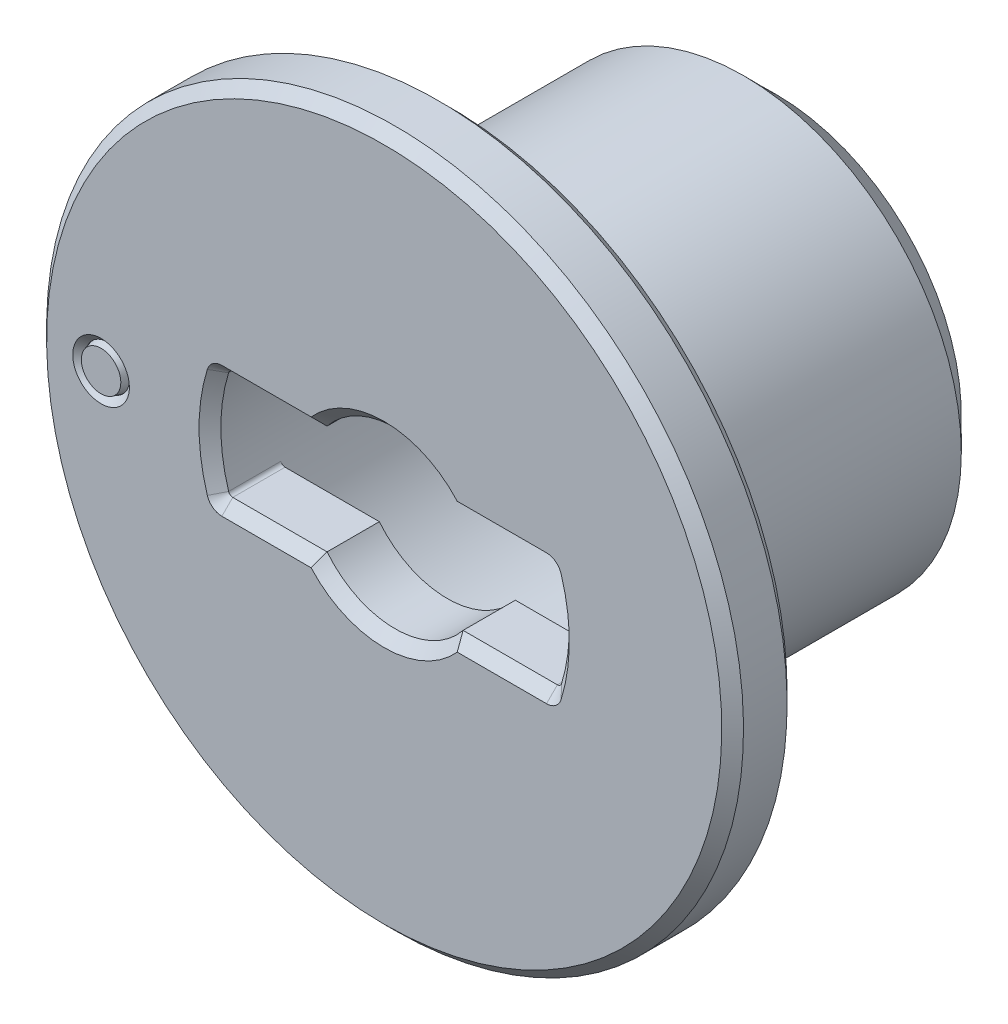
ISO-10303-21;
HEADER;
FILE_DESCRIPTION(('STEP AP214'),'2;1');
FILE_NAME('part.step','',(''),(''),'','','');
FILE_SCHEMA(('AUTOMOTIVE_DESIGN { 1 0 10303 214 1 1 1 1 }'));
ENDSEC;
DATA;
#1=APPLICATION_CONTEXT('core data for automotive mechanical design processes');
#2=APPLICATION_PROTOCOL_DEFINITION('international standard','automotive_design',2000,#1);
#3=PRODUCT_CONTEXT('',#1,'mechanical');
#4=PRODUCT('Part','Part','',(#3));
#5=PRODUCT_RELATED_PRODUCT_CATEGORY('part','',(#4));
#6=PRODUCT_DEFINITION_FORMATION('','',#4);
#7=PRODUCT_DEFINITION_CONTEXT('part definition',#1,'design');
#8=PRODUCT_DEFINITION('design','',#6,#7);
#9=PRODUCT_DEFINITION_SHAPE('','',#8);
#10=(LENGTH_UNIT() NAMED_UNIT(*) SI_UNIT(.MILLI.,.METRE.));
#11=(NAMED_UNIT(*) PLANE_ANGLE_UNIT() SI_UNIT($,.RADIAN.));
#12=(NAMED_UNIT(*) SI_UNIT($,.STERADIAN.) SOLID_ANGLE_UNIT());
#13=UNCERTAINTY_MEASURE_WITH_UNIT(LENGTH_MEASURE(1.E-05),#10,'distance_accuracy_value','');
#14=(GEOMETRIC_REPRESENTATION_CONTEXT(3) GLOBAL_UNCERTAINTY_ASSIGNED_CONTEXT((#13)) GLOBAL_UNIT_ASSIGNED_CONTEXT((#10,
#11,#12)) REPRESENTATION_CONTEXT('',''));
#15=CARTESIAN_POINT('',(0.,0.,0.));
#16=DIRECTION('',(0.,0.,1.));
#17=DIRECTION('',(1.,0.,0.));
#18=AXIS2_PLACEMENT_3D('',#15,#16,#17);
#19=CARTESIAN_POINT('',(-8.,0.,0.4));
#20=CARTESIAN_POINT('',(-8.,1.8259477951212,0.195464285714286));
#21=CARTESIAN_POINT('',(-7.20775094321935,3.47106991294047,-0.0090714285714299));
#22=CARTESIAN_POINT('',(-6.41550188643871,5.11619203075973,-0.213607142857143));
#23=CARTESIAN_POINT('',(-4.98791841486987,6.25465185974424,-0.418142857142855));
#24=CARTESIAN_POINT('',(-3.56033494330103,7.39311168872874,-0.622678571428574));
#25=CARTESIAN_POINT('',(-1.78016747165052,7.79942329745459,-0.827214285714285));
#26=CARTESIAN_POINT('',(0.,8.20573490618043,-1.03175));
#27=CARTESIAN_POINT('',(1.78016747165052,7.79942329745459,-1.23628571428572));
#28=CARTESIAN_POINT('',(3.56033494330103,7.39311168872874,-1.44082142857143));
#29=CARTESIAN_POINT('',(4.98791841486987,6.25465185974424,-1.64535714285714));
#30=CARTESIAN_POINT('',(6.41550188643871,5.11619203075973,-1.84989285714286));
#31=CARTESIAN_POINT('',(7.20775094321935,3.47106991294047,-2.05442857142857));
#32=CARTESIAN_POINT('',(8.,1.8259477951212,-2.25896428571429));
#33=CARTESIAN_POINT('',(8.,0.,-2.4635));
#34=CARTESIAN_POINT('',(0.,0.,0.4));
#35=CARTESIAN_POINT('',(0.,0.,0.195464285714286));
#36=CARTESIAN_POINT('',(0.,0.,-0.0090714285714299));
#37=CARTESIAN_POINT('',(0.,0.,-0.213607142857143));
#38=CARTESIAN_POINT('',(0.,0.,-0.418142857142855));
#39=CARTESIAN_POINT('',(0.,0.,-0.622678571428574));
#40=CARTESIAN_POINT('',(0.,0.,-0.827214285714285));
#41=CARTESIAN_POINT('',(0.,0.,-1.03175));
#42=CARTESIAN_POINT('',(0.,0.,-1.23628571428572));
#43=CARTESIAN_POINT('',(0.,0.,-1.44082142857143));
#44=CARTESIAN_POINT('',(0.,0.,-1.64535714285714));
#45=CARTESIAN_POINT('',(0.,0.,-1.84989285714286));
#46=CARTESIAN_POINT('',(0.,0.,-2.05442857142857));
#47=CARTESIAN_POINT('',(0.,0.,-2.25896428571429));
#48=CARTESIAN_POINT('',(0.,0.,-2.4635));
#49=(BOUNDED_SURFACE() B_SPLINE_SURFACE(1,2,((#19,#20,#21,#22,#23,#24,#25,#26,#27,#28,#29,#30,
#31,#32,#33),(#34,#35,#36,#37,#38,#39,#40,#41,#42,#43,#44,#45,#46,#47,#48)),.UNSPECIFIED.,.F.,
.F.,.F.) B_SPLINE_SURFACE_WITH_KNOTS((2,2),(3,2,2,2,2,2,2,3),(0.,1.),(0.,0.0714285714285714,
0.142857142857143,0.214285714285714,0.285714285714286,0.357142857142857,0.428571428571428,0.5),
.UNSPECIFIED.) GEOMETRIC_REPRESENTATION_ITEM() RATIONAL_B_SPLINE_SURFACE(((1.,0.974927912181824,
1.,0.974927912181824,1.,0.974927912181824,1.,0.974927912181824,1.,0.974927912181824,1.,
0.974927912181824,1.,0.974927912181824,1.),(1.,0.974927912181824,1.,0.974927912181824,1.,
0.974927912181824,1.,0.974927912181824,1.,0.974927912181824,1.,0.974927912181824,1.,
0.974927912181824,1.))) REPRESENTATION_ITEM('') SURFACE());
#50=CARTESIAN_POINT('',(-3.78617938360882,1.29028898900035,0.1));
#51=CARTESIAN_POINT('',(-4.41720928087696,1.50533715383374,0.1));
#52=CARTESIAN_POINT('',(-5.04823917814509,1.72038531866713,0.1));
#53=CARTESIAN_POINT('',(-6.31029897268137,2.15048164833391,0.1));
#54=CARTESIAN_POINT('',(-6.9413288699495,2.3655298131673,0.1));
#55=CARTESIAN_POINT('',(-7.57235876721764,2.5805779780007,0.1));
#56=B_SPLINE_CURVE_WITH_KNOTS('',3,(#50,#51,#52,#53,#54,#55),.UNSPECIFIED.,.F.,.F.,(4,2,4),(0.,
2.,4.),.UNSPECIFIED.);
#57=CARTESIAN_POINT('',(-7.33591353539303,2.5,0.1));
#58=VERTEX_POINT('',#57);
#59=CARTESIAN_POINT('',(-7.57235876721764,2.58057797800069,0.1));
#60=VERTEX_POINT('',#59);
#61=EDGE_CURVE('E158',#58,#60,#56,.T.);
#62=CARTESIAN_POINT('',(-3.12249899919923,2.5,-0.21538400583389));
#63=CARTESIAN_POINT('',(-3.30788065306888,2.5,-0.18878634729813));
#64=CARTESIAN_POINT('',(-3.49363193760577,2.5,-0.164973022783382));
#65=CARTESIAN_POINT('',(-3.86552133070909,2.5,-0.121901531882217));
#66=CARTESIAN_POINT('',(-4.05165903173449,2.5,-0.102639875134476));
#67=CARTESIAN_POINT('',(-4.42420773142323,2.5,-0.0676248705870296));
#68=CARTESIAN_POINT('',(-4.61061864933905,2.5,-0.0518706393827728));
#69=CARTESIAN_POINT('',(-4.98364937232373,2.5,-0.0231399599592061));
#70=CARTESIAN_POINT('',(-5.17026917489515,2.5,-0.0101634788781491));
#71=CARTESIAN_POINT('',(-5.54357650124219,2.5,0.0138371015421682));
#72=CARTESIAN_POINT('',(-5.73026398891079,2.5,0.0248617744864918));
#73=CARTESIAN_POINT('',(-6.10376909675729,2.5,0.0453426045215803));
#74=CARTESIAN_POINT('',(-6.29058673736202,2.5,0.0547983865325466));
#75=CARTESIAN_POINT('',(-6.66433826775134,2.5,0.0724315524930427));
#76=CARTESIAN_POINT('',(-6.85127217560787,2.5,0.0806085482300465));
#77=CARTESIAN_POINT('',(-7.2252467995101,2.5,0.0959030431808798));
#78=CARTESIAN_POINT('',(-7.41228753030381,2.5,0.103020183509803));
#79=CARTESIAN_POINT('',(-7.59934207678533,2.5,0.1097159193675));
#80=B_SPLINE_CURVE_WITH_KNOTS('',3,(#62,#63,#64,#65,#66,#67,#68,#69,#70,#71,#72,#73,#74,#75,#76,
#77,#78,#79),.UNSPECIFIED.,.F.,.F.,(4,2,2,2,2,2,2,2,4),(0.,0.5617764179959,1.123120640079,
1.68432331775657,2.2455193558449,2.80655019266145,3.36771496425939,3.92904976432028,
4.49057421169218),.UNSPECIFIED.);
#81=CARTESIAN_POINT('',(-7.45318723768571,2.5,0.104400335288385));
#82=VERTEX_POINT('',#81);
#83=EDGE_CURVE('E346',#58,#82,#80,.T.);
#84=CARTESIAN_POINT('',(-7.45318723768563,2.5,0.10440033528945));
#85=CARTESIAN_POINT('',(-7.46442948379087,2.50000966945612,0.104815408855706));
#86=CARTESIAN_POINT('',(-7.47566398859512,2.49905271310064,0.10533482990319));
#87=CARTESIAN_POINT('',(-7.49779714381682,2.49528138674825,0.106561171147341));
#88=CARTESIAN_POINT('',(-7.50869606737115,2.49246857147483,0.107267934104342));
#89=CARTESIAN_POINT('',(-7.52986041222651,2.48506012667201,0.108848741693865));
#90=CARTESIAN_POINT('',(-7.54012566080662,2.48046401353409,0.10972283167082));
#91=CARTESIAN_POINT('',(-7.55973156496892,2.46962801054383,0.111612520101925));
#92=CARTESIAN_POINT('',(-7.56907236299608,2.4633883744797,0.11262809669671));
#93=CARTESIAN_POINT('',(-7.58661305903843,2.44941196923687,0.114777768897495));
#94=CARTESIAN_POINT('',(-7.59480742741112,2.44166834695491,0.115912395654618));
#95=CARTESIAN_POINT('',(-7.60977612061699,2.42492375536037,0.118265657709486));
#96=CARTESIAN_POINT('',(-7.61655074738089,2.4159230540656,0.119484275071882));
#97=CARTESIAN_POINT('',(-7.62716888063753,2.39902900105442,0.121697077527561));
#98=CARTESIAN_POINT('',(-7.63132926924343,2.39133123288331,0.122681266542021));
#99=CARTESIAN_POINT('',(-7.63860678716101,2.37547097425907,0.124664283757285));
#100=CARTESIAN_POINT('',(-7.64172520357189,2.36730907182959,0.125663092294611));
#101=CARTESIAN_POINT('',(-7.6442946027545,2.35897435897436,0.126662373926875));
#102=B_SPLINE_CURVE_WITH_KNOTS('',3,(#84,#85,#86,#87,#88,#89,#90,#91,#92,#93,#94,#95,#96,#97,
#98,#99,#100,#101),.UNSPECIFIED.,.F.,.F.,(4,2,2,2,2,2,2,2,4),(0.,0.0337029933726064,
0.0673777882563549,0.101061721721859,0.13474045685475,0.168576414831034,0.202405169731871,
0.228749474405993,0.255061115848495),.UNSPECIFIED.);
#103=CARTESIAN_POINT('',(-7.6442946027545,2.35897435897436,0.12666237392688));
#104=VERTEX_POINT('',#103);
#105=EDGE_CURVE('E202',#82,#104,#102,.T.);
#106=CARTESIAN_POINT('',(-8.,0.,0.4));
#107=CARTESIAN_POINT('',(-8.,1.8259477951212,0.195464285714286));
#108=CARTESIAN_POINT('',(-7.20775094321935,3.47106991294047,-0.0090714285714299));
#109=CARTESIAN_POINT('',(-6.41550188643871,5.11619203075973,-0.213607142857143));
#110=CARTESIAN_POINT('',(-4.98791841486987,6.25465185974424,-0.418142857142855));
#111=CARTESIAN_POINT('',(-3.56033494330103,7.39311168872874,-0.622678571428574));
#112=CARTESIAN_POINT('',(-1.78016747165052,7.79942329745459,-0.827214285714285));
#113=CARTESIAN_POINT('',(0.,8.20573490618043,-1.03175));
#114=CARTESIAN_POINT('',(1.78016747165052,7.79942329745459,-1.23628571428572));
#115=CARTESIAN_POINT('',(3.56033494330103,7.39311168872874,-1.44082142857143));
#116=CARTESIAN_POINT('',(4.98791841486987,6.25465185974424,-1.64535714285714));
#117=CARTESIAN_POINT('',(6.41550188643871,5.11619203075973,-1.84989285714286));
#118=CARTESIAN_POINT('',(7.20775094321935,3.47106991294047,-2.05442857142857));
#119=CARTESIAN_POINT('',(8.,1.8259477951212,-2.25896428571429));
#120=CARTESIAN_POINT('',(8.,0.,-2.4635));
#121=(BOUNDED_CURVE() B_SPLINE_CURVE(2,(#106,#107,#108,#109,#110,#111,#112,#113,#114,#115,#116,
#117,#118,#119,#120),.UNSPECIFIED.,.F.,.F.) B_SPLINE_CURVE_WITH_KNOTS((3,2,2,2,2,2,2,3),(0.,
0.0714285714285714,0.142857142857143,0.214285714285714,0.285714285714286,0.357142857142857,
0.428571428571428,0.5),
.UNSPECIFIED.) CURVE() GEOMETRIC_REPRESENTATION_ITEM() RATIONAL_B_SPLINE_CURVE((1.,
0.974927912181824,1.,0.974927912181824,1.,0.974927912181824,1.,0.974927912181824,1.,
0.974927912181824,1.,0.974927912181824,1.,0.974927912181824,1.)) REPRESENTATION_ITEM(''));
#122=EDGE_CURVE('E343',#60,#104,#121,.F.);
#123=ORIENTED_EDGE('',*,*,#61,.F.);
#124=ORIENTED_EDGE('',*,*,#83,.T.);
#125=ORIENTED_EDGE('',*,*,#105,.T.);
#126=ORIENTED_EDGE('',*,*,#122,.F.);
#127=EDGE_LOOP('',(#123,#124,#125,#126));
#128=FACE_BOUND('',#127,.T.);
#129=ADVANCED_FACE('F14',(#128),#49,.F.);
#130=CARTESIAN_POINT('',(8.,0.,0.4));
#131=CARTESIAN_POINT('',(8.,-1.8259477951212,0.195464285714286));
#132=CARTESIAN_POINT('',(7.20775094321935,-3.47106991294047,-0.0090714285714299));
#133=CARTESIAN_POINT('',(6.41550188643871,-5.11619203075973,-0.213607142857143));
#134=CARTESIAN_POINT('',(4.98791841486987,-6.25465185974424,-0.41814285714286));
#135=CARTESIAN_POINT('',(3.56033494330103,-7.39311168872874,-0.622678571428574));
#136=CARTESIAN_POINT('',(1.78016747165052,-7.79942329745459,-0.827214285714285));
#137=CARTESIAN_POINT('',(0.,-8.20573490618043,-1.03175));
#138=CARTESIAN_POINT('',(-1.78016747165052,-7.79942329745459,-1.23628571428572));
#139=CARTESIAN_POINT('',(-3.56033494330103,-7.39311168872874,-1.44082142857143));
#140=CARTESIAN_POINT('',(-4.98791841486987,-6.25465185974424,-1.64535714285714));
#141=CARTESIAN_POINT('',(-6.41550188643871,-5.11619203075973,-1.84989285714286));
#142=CARTESIAN_POINT('',(-7.20775094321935,-3.47106991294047,-2.05442857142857));
#143=CARTESIAN_POINT('',(-8.,-1.8259477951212,-2.25896428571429));
#144=CARTESIAN_POINT('',(-8.,0.,-2.4635));
#145=CARTESIAN_POINT('',(0.,0.,0.4));
#146=CARTESIAN_POINT('',(0.,0.,0.195464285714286));
#147=CARTESIAN_POINT('',(0.,0.,-0.0090714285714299));
#148=CARTESIAN_POINT('',(0.,0.,-0.213607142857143));
#149=CARTESIAN_POINT('',(0.,0.,-0.41814285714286));
#150=CARTESIAN_POINT('',(0.,0.,-0.622678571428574));
#151=CARTESIAN_POINT('',(0.,0.,-0.827214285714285));
#152=CARTESIAN_POINT('',(0.,0.,-1.03175));
#153=CARTESIAN_POINT('',(0.,0.,-1.23628571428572));
#154=CARTESIAN_POINT('',(0.,0.,-1.44082142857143));
#155=CARTESIAN_POINT('',(0.,0.,-1.64535714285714));
#156=CARTESIAN_POINT('',(0.,0.,-1.84989285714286));
#157=CARTESIAN_POINT('',(0.,0.,-2.05442857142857));
#158=CARTESIAN_POINT('',(0.,0.,-2.25896428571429));
#159=CARTESIAN_POINT('',(0.,0.,-2.4635));
#160=(BOUNDED_SURFACE() B_SPLINE_SURFACE(1,2,((#130,#131,#132,#133,#134,#135,#136,#137,#138,
#139,#140,#141,#142,#143,#144),(#145,#146,#147,#148,#149,#150,#151,#152,#153,#154,#155,#156,
#157,#158,#159)),.UNSPECIFIED.,.F.,.F.,.F.) B_SPLINE_SURFACE_WITH_KNOTS((2,2),(3,2,2,2,2,2,2,3),
(0.,1.),(0.0625,0.125,0.1875,0.25,0.3125,0.375,0.4375,0.5),
.UNSPECIFIED.) GEOMETRIC_REPRESENTATION_ITEM() RATIONAL_B_SPLINE_SURFACE(((1.,0.974927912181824,
1.,0.974927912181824,1.,0.974927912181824,1.,0.974927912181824,1.,0.974927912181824,1.,
0.974927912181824,1.,0.974927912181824,1.),(1.,0.974927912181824,1.,0.974927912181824,1.,
0.974927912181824,1.,0.974927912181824,1.,0.974927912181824,1.,0.974927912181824,1.,
0.974927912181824,1.))) REPRESENTATION_ITEM('') SURFACE());
#161=CARTESIAN_POINT('',(3.78617938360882,-1.29028898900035,0.1));
#162=CARTESIAN_POINT('',(4.41720928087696,-1.50533715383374,0.1));
#163=CARTESIAN_POINT('',(5.04823917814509,-1.72038531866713,0.1));
#164=CARTESIAN_POINT('',(6.31029897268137,-2.15048164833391,0.1));
#165=CARTESIAN_POINT('',(6.9413288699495,-2.3655298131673,0.1));
#166=CARTESIAN_POINT('',(7.57235876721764,-2.58057797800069,0.1));
#167=B_SPLINE_CURVE_WITH_KNOTS('',3,(#161,#162,#163,#164,#165,#166),.UNSPECIFIED.,.F.,.F.,(4,2,
4),(0.,2.,4.),.UNSPECIFIED.);
#168=CARTESIAN_POINT('',(7.33591353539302,-2.5,0.1));
#169=VERTEX_POINT('',#168);
#170=CARTESIAN_POINT('',(7.57235876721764,-2.58057797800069,0.1));
#171=VERTEX_POINT('',#170);
#172=EDGE_CURVE('E591',#169,#171,#167,.T.);
#173=CARTESIAN_POINT('',(3.12249899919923,-2.5,-0.21538400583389));
#174=CARTESIAN_POINT('',(3.30788065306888,-2.5,-0.188786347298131));
#175=CARTESIAN_POINT('',(3.49363193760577,-2.5,-0.164973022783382));
#176=CARTESIAN_POINT('',(3.86552133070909,-2.5,-0.121901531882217));
#177=CARTESIAN_POINT('',(4.05165903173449,-2.5,-0.102639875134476));
#178=CARTESIAN_POINT('',(4.42420773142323,-2.5,-0.0676248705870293));
#179=CARTESIAN_POINT('',(4.61061864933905,-2.5,-0.0518706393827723));
#180=CARTESIAN_POINT('',(4.98364937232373,-2.5,-0.0231399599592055));
#181=CARTESIAN_POINT('',(5.17026917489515,-2.5,-0.0101634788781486));
#182=CARTESIAN_POINT('',(5.54357650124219,-2.5,0.0138371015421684));
#183=CARTESIAN_POINT('',(5.73026398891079,-2.5,0.024861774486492));
#184=CARTESIAN_POINT('',(6.10376909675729,-2.5,0.0453426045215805));
#185=CARTESIAN_POINT('',(6.29058673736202,-2.5,0.0547983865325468));
#186=CARTESIAN_POINT('',(6.66433826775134,-2.5,0.072431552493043));
#187=CARTESIAN_POINT('',(6.85127217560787,-2.5,0.0806085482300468));
#188=CARTESIAN_POINT('',(7.2252467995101,-2.5,0.09590304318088));
#189=CARTESIAN_POINT('',(7.41228753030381,-2.5,0.103020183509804));
#190=CARTESIAN_POINT('',(7.59934207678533,-2.5,0.1097159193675));
#191=B_SPLINE_CURVE_WITH_KNOTS('',3,(#173,#174,#175,#176,#177,#178,#179,#180,#181,#182,#183,
#184,#185,#186,#187,#188,#189,#190),.UNSPECIFIED.,.F.,.F.,(4,2,2,2,2,2,2,2,4),(0.,
0.5617764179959,1.123120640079,1.68432331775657,2.2455193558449,2.80655019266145,
3.36771496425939,3.92904976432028,4.49057421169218),.UNSPECIFIED.);
#192=CARTESIAN_POINT('',(7.45318723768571,-2.5,0.104400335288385));
#193=VERTEX_POINT('',#192);
#194=EDGE_CURVE('E461',#169,#193,#191,.T.);
#195=CARTESIAN_POINT('',(7.45318723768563,-2.5,0.10440033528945));
#196=CARTESIAN_POINT('',(7.46442948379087,-2.50000966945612,0.104815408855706));
#197=CARTESIAN_POINT('',(7.47566398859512,-2.49905271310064,0.10533482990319));
#198=CARTESIAN_POINT('',(7.49779714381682,-2.49528138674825,0.106561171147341));
#199=CARTESIAN_POINT('',(7.50869606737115,-2.49246857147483,0.107267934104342));
#200=CARTESIAN_POINT('',(7.52986041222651,-2.48506012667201,0.108848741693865));
#201=CARTESIAN_POINT('',(7.54012566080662,-2.48046401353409,0.10972283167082));
#202=CARTESIAN_POINT('',(7.55973156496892,-2.46962801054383,0.111612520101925));
#203=CARTESIAN_POINT('',(7.56907236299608,-2.4633883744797,0.11262809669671));
#204=CARTESIAN_POINT('',(7.58661305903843,-2.44941196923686,0.114777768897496));
#205=CARTESIAN_POINT('',(7.59480742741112,-2.44166834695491,0.115912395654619));
#206=CARTESIAN_POINT('',(7.60977612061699,-2.42492375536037,0.118265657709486));
#207=CARTESIAN_POINT('',(7.6165507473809,-2.4159230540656,0.119484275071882));
#208=CARTESIAN_POINT('',(7.62716888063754,-2.39902900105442,0.12169707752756));
#209=CARTESIAN_POINT('',(7.63132926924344,-2.39133123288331,0.122681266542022));
#210=CARTESIAN_POINT('',(7.63860678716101,-2.37547097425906,0.124664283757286));
#211=CARTESIAN_POINT('',(7.64172520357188,-2.36730907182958,0.125663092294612));
#212=CARTESIAN_POINT('',(7.6442946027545,-2.35897435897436,0.126662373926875));
#213=B_SPLINE_CURVE_WITH_KNOTS('',3,(#195,#196,#197,#198,#199,#200,#201,#202,#203,#204,#205,
#206,#207,#208,#209,#210,#211,#212),.UNSPECIFIED.,.F.,.F.,(4,2,2,2,2,2,2,2,4),(0.,
0.0337029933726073,0.0673777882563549,0.10106172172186,0.134740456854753,0.168576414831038,
0.202405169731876,0.228749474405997,0.2550611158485),.UNSPECIFIED.);
#214=CARTESIAN_POINT('',(7.64429460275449,-2.35897435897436,0.12666237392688));
#215=VERTEX_POINT('',#214);
#216=EDGE_CURVE('E193',#193,#215,#213,.T.);
#217=CARTESIAN_POINT('',(8.,0.,0.4));
#218=CARTESIAN_POINT('',(8.,-1.8259477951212,0.195464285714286));
#219=CARTESIAN_POINT('',(7.20775094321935,-3.47106991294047,-0.0090714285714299));
#220=CARTESIAN_POINT('',(6.41550188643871,-5.11619203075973,-0.213607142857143));
#221=CARTESIAN_POINT('',(4.98791841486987,-6.25465185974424,-0.41814285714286));
#222=CARTESIAN_POINT('',(3.56033494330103,-7.39311168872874,-0.622678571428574));
#223=CARTESIAN_POINT('',(1.78016747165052,-7.79942329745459,-0.827214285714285));
#224=CARTESIAN_POINT('',(0.,-8.20573490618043,-1.03175));
#225=CARTESIAN_POINT('',(-1.78016747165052,-7.79942329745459,-1.23628571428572));
#226=CARTESIAN_POINT('',(-3.56033494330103,-7.39311168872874,-1.44082142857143));
#227=CARTESIAN_POINT('',(-4.98791841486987,-6.25465185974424,-1.64535714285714));
#228=CARTESIAN_POINT('',(-6.41550188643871,-5.11619203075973,-1.84989285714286));
#229=CARTESIAN_POINT('',(-7.20775094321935,-3.47106991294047,-2.05442857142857));
#230=CARTESIAN_POINT('',(-8.,-1.8259477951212,-2.25896428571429));
#231=CARTESIAN_POINT('',(-8.,0.,-2.4635));
#232=(BOUNDED_CURVE() B_SPLINE_CURVE(2,(#217,#218,#219,#220,#221,#222,#223,#224,#225,#226,#227,
#228,#229,#230,#231),.UNSPECIFIED.,.F.,.F.) B_SPLINE_CURVE_WITH_KNOTS((3,2,2,2,2,2,2,3),(0.0625,
0.125,0.1875,0.25,0.3125,0.375,0.4375,0.5),
.UNSPECIFIED.) CURVE() GEOMETRIC_REPRESENTATION_ITEM() RATIONAL_B_SPLINE_CURVE((1.,
0.974927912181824,1.,0.974927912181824,1.,0.974927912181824,1.,0.974927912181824,1.,
0.974927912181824,1.,0.974927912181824,1.,0.974927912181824,1.)) REPRESENTATION_ITEM(''));
#233=EDGE_CURVE('E19',#171,#215,#232,.F.);
#234=ORIENTED_EDGE('',*,*,#172,.F.);
#235=ORIENTED_EDGE('',*,*,#194,.T.);
#236=ORIENTED_EDGE('',*,*,#216,.T.);
#237=ORIENTED_EDGE('',*,*,#233,.F.);
#238=EDGE_LOOP('',(#234,#235,#236,#237));
#239=FACE_BOUND('',#238,.T.);
#240=ADVANCED_FACE('F210',(#239),#160,.F.);
#241=CARTESIAN_POINT('',(7.45318723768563,2.3,3.));
#242=DIRECTION('',(0.,0.,1.));
#243=DIRECTION('',(0.,-1.,0.));
#244=AXIS2_PLACEMENT_3D('',#241,#242,#243);
#245=CYLINDRICAL_SURFACE('',#244,0.2);
#246=CARTESIAN_POINT('',(7.45318723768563,2.3,0.1));
#247=DIRECTION('',(0.,0.,-1.));
#248=DIRECTION('',(0.,1.,0.));
#249=AXIS2_PLACEMENT_3D('',#246,#247,#248);
#250=CIRCLE('',#249,0.2);
#251=CARTESIAN_POINT('',(7.6442946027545,2.35897435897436,0.1));
#252=VERTEX_POINT('',#251);
#253=CARTESIAN_POINT('',(7.45318723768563,2.5,0.1));
#254=VERTEX_POINT('',#253);
#255=EDGE_CURVE('E155',#252,#254,#250,.F.);
#256=ORIENTED_EDGE('',*,*,#255,.F.);
#257=DIRECTION('',(0.,0.,1.));
#258=VECTOR('',#257,1.);
#259=CARTESIAN_POINT('',(7.6442946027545,2.35897435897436,3.));
#260=LINE('',#259,#258);
#261=CARTESIAN_POINT('',(7.6442946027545,2.35897435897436,2.5));
#262=VERTEX_POINT('',#261);
#263=EDGE_CURVE('E169',#262,#252,#260,.F.);
#264=ORIENTED_EDGE('',*,*,#263,.F.);
#265=CARTESIAN_POINT('',(7.45318723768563,2.3,2.5));
#266=DIRECTION('',(0.,0.,1.));
#267=DIRECTION('',(0.,-1.,0.));
#268=AXIS2_PLACEMENT_3D('',#265,#266,#267);
#269=CIRCLE('',#268,0.2);
#270=CARTESIAN_POINT('',(7.45318723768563,2.5,2.5));
#271=VERTEX_POINT('',#270);
#272=EDGE_CURVE('E295',#262,#271,#269,.T.);
#273=ORIENTED_EDGE('',*,*,#272,.T.);
#274=DIRECTION('',(0.,0.,-1.));
#275=VECTOR('',#274,1.);
#276=CARTESIAN_POINT('',(7.45318723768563,2.5,3.));
#277=LINE('',#276,#275);
#278=EDGE_CURVE('E171',#254,#271,#277,.F.);
#279=ORIENTED_EDGE('',*,*,#278,.F.);
#280=EDGE_LOOP('',(#256,#264,#273,#279));
#281=FACE_BOUND('',#280,.T.);
#282=ADVANCED_FACE('F167',(#281),#245,.F.);
#283=CARTESIAN_POINT('',(-7.59934207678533,2.5,-2.93175));
#284=DIRECTION('',(0.,1.,0.));
#285=DIRECTION('',(-1.,0.,0.));
#286=AXIS2_PLACEMENT_3D('',#283,#284,#285);
#287=PLANE('',#286);
#288=DIRECTION('',(-1.,0.,0.));
#289=VECTOR('',#288,1.);
#290=CARTESIAN_POINT('',(-7.59934207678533,2.5,0.1));
#291=LINE('',#290,#289);
#292=CARTESIAN_POINT('',(3.1224989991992,2.5,0.1));
#293=VERTEX_POINT('',#292);
#294=EDGE_CURVE('E172',#254,#293,#291,.T.);
#295=ORIENTED_EDGE('',*,*,#294,.F.);
#296=ORIENTED_EDGE('',*,*,#278,.T.);
#297=DIRECTION('',(-1.,0.,0.));
#298=VECTOR('',#297,1.);
#299=CARTESIAN_POINT('',(3.74165738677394,2.5,2.5));
#300=LINE('',#299,#298);
#301=CARTESIAN_POINT('',(3.1224989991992,2.5,2.5));
#302=VERTEX_POINT('',#301);
#303=EDGE_CURVE('E292',#271,#302,#300,.T.);
#304=ORIENTED_EDGE('',*,*,#303,.T.);
#305=DIRECTION('',(0.,0.,1.));
#306=VECTOR('',#305,1.);
#307=CARTESIAN_POINT('',(3.1224989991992,2.5,-7.));
#308=LINE('',#307,#306);
#309=EDGE_CURVE('E470',#293,#302,#308,.T.);
#310=ORIENTED_EDGE('',*,*,#309,.F.);
#311=EDGE_LOOP('',(#295,#296,#304,#310));
#312=FACE_BOUND('',#311,.T.);
#313=ADVANCED_FACE('F495',(#312),#287,.F.);
#314=CARTESIAN_POINT('',(0.,0.,-7.));
#315=DIRECTION('',(0.,0.,1.));
#316=DIRECTION('',(0.,-1.,0.));
#317=AXIS2_PLACEMENT_3D('',#314,#315,#316);
#318=CYLINDRICAL_SURFACE('',#317,4.);
#319=CARTESIAN_POINT('',(0.,0.,0.1));
#320=DIRECTION('',(0.,0.,-1.));
#321=DIRECTION('',(0.,1.,0.));
#322=AXIS2_PLACEMENT_3D('',#319,#320,#321);
#323=CIRCLE('',#322,4.);
#324=CARTESIAN_POINT('',(-3.1224989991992,2.5,0.1));
#325=VERTEX_POINT('',#324);
#326=EDGE_CURVE('E33',#293,#325,#323,.F.);
#327=ORIENTED_EDGE('',*,*,#326,.F.);
#328=ORIENTED_EDGE('',*,*,#309,.T.);
#329=CARTESIAN_POINT('',(0.,0.,2.5));
#330=DIRECTION('',(0.,0.,1.));
#331=DIRECTION('',(0.,-1.,0.));
#332=AXIS2_PLACEMENT_3D('',#329,#330,#331);
#333=CIRCLE('',#332,4.);
#334=CARTESIAN_POINT('',(-3.1224989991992,2.5,2.5));
#335=VERTEX_POINT('',#334);
#336=EDGE_CURVE('E396',#302,#335,#333,.T.);
#337=ORIENTED_EDGE('',*,*,#336,.T.);
#338=DIRECTION('',(0.,0.,1.));
#339=VECTOR('',#338,1.);
#340=CARTESIAN_POINT('',(-3.1224989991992,2.5,-7.));
#341=LINE('',#340,#339);
#342=EDGE_CURVE('E604',#335,#325,#341,.F.);
#343=ORIENTED_EDGE('',*,*,#342,.T.);
#344=EDGE_LOOP('',(#327,#328,#337,#343));
#345=FACE_BOUND('',#344,.T.);
#346=ADVANCED_FACE('F498',(#345),#318,.F.);
#347=DIRECTION('',(-1.,0.,0.));
#348=VECTOR('',#347,1.);
#349=CARTESIAN_POINT('',(-7.59934207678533,2.5,0.1));
#350=LINE('',#349,#348);
#351=EDGE_CURVE('E598',#325,#58,#350,.T.);
#352=ORIENTED_EDGE('',*,*,#351,.F.);
#353=ORIENTED_EDGE('',*,*,#342,.F.);
#354=DIRECTION('',(-1.,0.,0.));
#355=VECTOR('',#354,1.);
#356=CARTESIAN_POINT('',(-7.45318723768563,2.5,2.5));
#357=LINE('',#356,#355);
#358=CARTESIAN_POINT('',(-7.45318723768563,2.5,2.5));
#359=VERTEX_POINT('',#358);
#360=EDGE_CURVE('E426',#335,#359,#357,.T.);
#361=ORIENTED_EDGE('',*,*,#360,.T.);
#362=DIRECTION('',(0.,0.,-1.));
#363=VECTOR('',#362,1.);
#364=CARTESIAN_POINT('',(-7.45318723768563,2.5,0.109715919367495));
#365=LINE('',#364,#363);
#366=EDGE_CURVE('E190',#359,#82,#365,.T.);
#367=ORIENTED_EDGE('',*,*,#366,.T.);
#368=ORIENTED_EDGE('',*,*,#83,.F.);
#369=EDGE_LOOP('',(#352,#353,#361,#367,#368));
#370=FACE_BOUND('',#369,.T.);
#371=ADVANCED_FACE('F229',(#370),#287,.F.);
#372=CARTESIAN_POINT('',(-7.45318723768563,-2.3,3.));
#373=DIRECTION('',(0.,0.,1.));
#374=DIRECTION('',(0.,-1.,0.));
#375=AXIS2_PLACEMENT_3D('',#372,#373,#374);
#376=CYLINDRICAL_SURFACE('',#375,0.2);
#377=CARTESIAN_POINT('',(-7.45318723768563,-2.3,0.1));
#378=DIRECTION('',(0.,0.,-1.));
#379=DIRECTION('',(0.,1.,0.));
#380=AXIS2_PLACEMENT_3D('',#377,#378,#379);
#381=CIRCLE('',#380,0.2);
#382=CARTESIAN_POINT('',(-7.6442946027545,-2.35897435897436,0.1));
#383=VERTEX_POINT('',#382);
#384=CARTESIAN_POINT('',(-7.45318723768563,-2.5,0.1));
#385=VERTEX_POINT('',#384);
#386=EDGE_CURVE('E414',#383,#385,#381,.F.);
#387=ORIENTED_EDGE('',*,*,#386,.F.);
#388=DIRECTION('',(0.,0.,1.));
#389=VECTOR('',#388,1.);
#390=CARTESIAN_POINT('',(-7.6442946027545,-2.35897435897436,3.));
#391=LINE('',#390,#389);
#392=CARTESIAN_POINT('',(-7.6442946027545,-2.35897435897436,2.5));
#393=VERTEX_POINT('',#392);
#394=EDGE_CURVE('E185',#393,#383,#391,.F.);
#395=ORIENTED_EDGE('',*,*,#394,.F.);
#396=CARTESIAN_POINT('',(-7.45318723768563,-2.3,2.5));
#397=DIRECTION('',(0.,0.,1.));
#398=DIRECTION('',(0.,-1.,0.));
#399=AXIS2_PLACEMENT_3D('',#396,#397,#398);
#400=CIRCLE('',#399,0.2);
#401=CARTESIAN_POINT('',(-7.45318723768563,-2.5,2.5));
#402=VERTEX_POINT('',#401);
#403=EDGE_CURVE('E412',#393,#402,#400,.T.);
#404=ORIENTED_EDGE('',*,*,#403,.T.);
#405=DIRECTION('',(0.,0.,-1.));
#406=VECTOR('',#405,1.);
#407=CARTESIAN_POINT('',(-7.45318723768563,-2.5,3.));
#408=LINE('',#407,#406);
#409=EDGE_CURVE('E183',#385,#402,#408,.F.);
#410=ORIENTED_EDGE('',*,*,#409,.F.);
#411=EDGE_LOOP('',(#387,#395,#404,#410));
#412=FACE_BOUND('',#411,.T.);
#413=ADVANCED_FACE('F226',(#412),#376,.F.);
#414=CARTESIAN_POINT('',(-7.59934207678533,-2.5,-2.93175));
#415=DIRECTION('',(0.,-1.,0.));
#416=DIRECTION('',(1.,0.,0.));
#417=AXIS2_PLACEMENT_3D('',#414,#415,#416);
#418=PLANE('',#417);
#419=DIRECTION('',(1.,0.,0.));
#420=VECTOR('',#419,1.);
#421=CARTESIAN_POINT('',(-7.59934207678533,-2.5,0.1));
#422=LINE('',#421,#420);
#423=CARTESIAN_POINT('',(-3.1224989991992,-2.5,0.1));
#424=VERTEX_POINT('',#423);
#425=EDGE_CURVE('E642',#385,#424,#422,.T.);
#426=ORIENTED_EDGE('',*,*,#425,.F.);
#427=ORIENTED_EDGE('',*,*,#409,.T.);
#428=DIRECTION('',(1.,0.,0.));
#429=VECTOR('',#428,1.);
#430=CARTESIAN_POINT('',(-3.74165738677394,-2.5,2.5));
#431=LINE('',#430,#429);
#432=CARTESIAN_POINT('',(-3.1224989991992,-2.5,2.5));
#433=VERTEX_POINT('',#432);
#434=EDGE_CURVE('E424',#402,#433,#431,.T.);
#435=ORIENTED_EDGE('',*,*,#434,.T.);
#436=DIRECTION('',(0.,0.,1.));
#437=VECTOR('',#436,1.);
#438=CARTESIAN_POINT('',(-3.1224989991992,-2.5,-7.));
#439=LINE('',#438,#437);
#440=EDGE_CURVE('E471',#424,#433,#439,.T.);
#441=ORIENTED_EDGE('',*,*,#440,.F.);
#442=EDGE_LOOP('',(#426,#427,#435,#441));
#443=FACE_BOUND('',#442,.T.);
#444=ADVANCED_FACE('F228',(#443),#418,.F.);
#445=CARTESIAN_POINT('',(0.,0.,-7.));
#446=DIRECTION('',(0.,0.,1.));
#447=DIRECTION('',(0.,-1.,0.));
#448=AXIS2_PLACEMENT_3D('',#445,#446,#447);
#449=CYLINDRICAL_SURFACE('',#448,4.);
#450=CARTESIAN_POINT('',(0.,0.,0.1));
#451=DIRECTION('',(0.,0.,-1.));
#452=DIRECTION('',(0.,1.,0.));
#453=AXIS2_PLACEMENT_3D('',#450,#451,#452);
#454=CIRCLE('',#453,4.);
#455=CARTESIAN_POINT('',(3.1224989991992,-2.5,0.1));
#456=VERTEX_POINT('',#455);
#457=EDGE_CURVE('E40',#424,#456,#454,.F.);
#458=ORIENTED_EDGE('',*,*,#457,.F.);
#459=ORIENTED_EDGE('',*,*,#440,.T.);
#460=CARTESIAN_POINT('',(0.,0.,2.5));
#461=DIRECTION('',(0.,0.,1.));
#462=DIRECTION('',(0.,-1.,0.));
#463=AXIS2_PLACEMENT_3D('',#460,#461,#462);
#464=CIRCLE('',#463,4.);
#465=CARTESIAN_POINT('',(3.1224989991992,-2.5,2.5));
#466=VERTEX_POINT('',#465);
#467=EDGE_CURVE('E387',#433,#466,#464,.T.);
#468=ORIENTED_EDGE('',*,*,#467,.T.);
#469=DIRECTION('',(0.,0.,1.));
#470=VECTOR('',#469,1.);
#471=CARTESIAN_POINT('',(3.1224989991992,-2.5,-7.));
#472=LINE('',#471,#470);
#473=EDGE_CURVE('E472',#466,#456,#472,.F.);
#474=ORIENTED_EDGE('',*,*,#473,.T.);
#475=EDGE_LOOP('',(#458,#459,#468,#474));
#476=FACE_BOUND('',#475,.T.);
#477=ADVANCED_FACE('F477',(#476),#449,.F.);
#478=DIRECTION('',(1.,0.,0.));
#479=VECTOR('',#478,1.);
#480=CARTESIAN_POINT('',(-7.59934207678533,-2.5,0.1));
#481=LINE('',#480,#479);
#482=EDGE_CURVE('E9',#456,#169,#481,.T.);
#483=ORIENTED_EDGE('',*,*,#482,.F.);
#484=ORIENTED_EDGE('',*,*,#473,.F.);
#485=DIRECTION('',(1.,0.,0.));
#486=VECTOR('',#485,1.);
#487=CARTESIAN_POINT('',(7.45318723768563,-2.5,2.5));
#488=LINE('',#487,#486);
#489=CARTESIAN_POINT('',(7.45318723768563,-2.5,2.5));
#490=VERTEX_POINT('',#489);
#491=EDGE_CURVE('E615',#466,#490,#488,.T.);
#492=ORIENTED_EDGE('',*,*,#491,.T.);
#493=DIRECTION('',(0.,0.,-1.));
#494=VECTOR('',#493,1.);
#495=CARTESIAN_POINT('',(7.45318723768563,-2.5,0.1097159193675));
#496=LINE('',#495,#494);
#497=EDGE_CURVE('E179',#490,#193,#496,.T.);
#498=ORIENTED_EDGE('',*,*,#497,.T.);
#499=ORIENTED_EDGE('',*,*,#194,.F.);
#500=EDGE_LOOP('',(#483,#484,#492,#498,#499));
#501=FACE_BOUND('',#500,.T.);
#502=ADVANCED_FACE('F479',(#501),#418,.F.);
#503=CARTESIAN_POINT('',(-13.,0.,3.));
#504=DIRECTION('',(0.,0.,-1.));
#505=DIRECTION('',(0.994723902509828,-0.102588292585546,0.));
#506=AXIS2_PLACEMENT_3D('',#503,#504,#505);
#507=PLANE('',#506);
#508=CARTESIAN_POINT('',(-13.,0.,3.));
#509=DIRECTION('',(0.,0.,-1.));
#510=DIRECTION('',(0.994723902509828,-0.102588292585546,0.));
#511=AXIS2_PLACEMENT_3D('',#508,#509,#510);
#512=CIRCLE('',#511,0.906217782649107);
#513=CARTESIAN_POINT('',(-12.0985635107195,-0.0929673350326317,3.));
#514=VERTEX_POINT('',#513);
#515=EDGE_CURVE('E451',#514,#514,#512,.F.);
#516=ORIENTED_EDGE('',*,*,#515,.T.);
#517=EDGE_LOOP('',(#516));
#518=FACE_BOUND('',#517,.T.);
#519=ADVANCED_FACE('F584',(#518),#507,.F.);
#520=CARTESIAN_POINT('',(-13.,0.,2.65));
#521=DIRECTION('',(0.,0.,-1.));
#522=DIRECTION('',(0.994723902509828,-0.102588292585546,0.));
#523=AXIS2_PLACEMENT_3D('',#520,#521,#522);
#524=CONICAL_SURFACE('',#523,1.,0.261799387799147);
#525=ORIENTED_EDGE('',*,*,#515,.F.);
#526=EDGE_LOOP('',(#525));
#527=FACE_BOUND('',#526,.T.);
#528=CARTESIAN_POINT('',(-13.,0.,2.65));
#529=DIRECTION('',(0.,0.,-1.));
#530=DIRECTION('',(0.994723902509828,-0.102588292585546,0.));
#531=AXIS2_PLACEMENT_3D('',#528,#529,#530);
#532=CIRCLE('',#531,1.);
#533=CARTESIAN_POINT('',(-12.0052760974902,-0.102588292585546,2.65));
#534=VERTEX_POINT('',#533);
#535=EDGE_CURVE('E440',#534,#534,#532,.T.);
#536=ORIENTED_EDGE('',*,*,#535,.F.);
#537=EDGE_LOOP('',(#536));
#538=FACE_BOUND('',#537,.T.);
#539=ADVANCED_FACE('F554',(#527,#538),#524,.T.);
#540=CARTESIAN_POINT('',(-13.,0.,-2.));
#541=DIRECTION('',(0.,0.,1.));
#542=DIRECTION('',(-0.994723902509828,0.102588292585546,0.));
#543=AXIS2_PLACEMENT_3D('',#540,#541,#542);
#544=CYLINDRICAL_SURFACE('',#543,1.);
#545=CARTESIAN_POINT('',(-13.,0.,0.3));
#546=DIRECTION('',(0.,0.,-1.));
#547=DIRECTION('',(0.,1.,0.));
#548=AXIS2_PLACEMENT_3D('',#545,#546,#547);
#549=CIRCLE('',#548,1.);
#550=CARTESIAN_POINT('',(-13.,1.,0.3));
#551=VERTEX_POINT('',#550);
#552=EDGE_CURVE('E25',#551,#551,#549,.T.);
#553=ORIENTED_EDGE('',*,*,#552,.T.);
#554=EDGE_LOOP('',(#553));
#555=FACE_BOUND('',#554,.T.);
#556=CARTESIAN_POINT('',(-13.,0.,-1.8));
#557=DIRECTION('',(0.,0.,-1.));
#558=DIRECTION('',(0.994723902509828,-0.102588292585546,0.));
#559=AXIS2_PLACEMENT_3D('',#556,#557,#558);
#560=CIRCLE('',#559,1.);
#561=CARTESIAN_POINT('',(-12.0052760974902,-0.102588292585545,-1.8));
#562=VERTEX_POINT('',#561);
#563=EDGE_CURVE('E435',#562,#562,#560,.F.);
#564=ORIENTED_EDGE('',*,*,#563,.T.);
#565=EDGE_LOOP('',(#564));
#566=FACE_BOUND('',#565,.T.);
#567=ADVANCED_FACE('F576',(#555,#566),#544,.T.);
#568=CARTESIAN_POINT('',(-13.,0.,-2.));
#569=DIRECTION('',(0.,0.,-1.));
#570=DIRECTION('',(0.994723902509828,-0.102588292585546,0.));
#571=AXIS2_PLACEMENT_3D('',#568,#569,#570);
#572=PLANE('',#571);
#573=CARTESIAN_POINT('',(-13.,0.,-2.));
#574=DIRECTION('',(0.,0.,-1.));
#575=DIRECTION('',(0.994723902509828,-0.102588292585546,0.));
#576=AXIS2_PLACEMENT_3D('',#573,#574,#575);
#577=CIRCLE('',#576,0.8);
#578=CARTESIAN_POINT('',(-12.2042208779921,-0.0820706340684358,-2.));
#579=VERTEX_POINT('',#578);
#580=EDGE_CURVE('E429',#579,#579,#577,.T.);
#581=ORIENTED_EDGE('',*,*,#580,.T.);
#582=EDGE_LOOP('',(#581));
#583=FACE_BOUND('',#582,.T.);
#584=ADVANCED_FACE('F564',(#583),#572,.T.);
#585=CARTESIAN_POINT('',(-13.,0.,-2.));
#586=DIRECTION('',(0.,0.,1.));
#587=DIRECTION('',(-0.994723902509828,0.102588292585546,0.));
#588=AXIS2_PLACEMENT_3D('',#585,#586,#587);
#589=CONICAL_SURFACE('',#588,0.8,0.785398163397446);
#590=ORIENTED_EDGE('',*,*,#563,.F.);
#591=EDGE_LOOP('',(#590));
#592=FACE_BOUND('',#591,.T.);
#593=ORIENTED_EDGE('',*,*,#580,.F.);
#594=EDGE_LOOP('',(#593));
#595=FACE_BOUND('',#594,.T.);
#596=ADVANCED_FACE('F550',(#592,#595),#589,.T.);
#597=CARTESIAN_POINT('',(10.,0.,-15.));
#598=DIRECTION('',(0.,0.,1.));
#599=DIRECTION('',(0.,-1.,0.));
#600=AXIS2_PLACEMENT_3D('',#597,#598,#599);
#601=PLANE('',#600);
#602=CARTESIAN_POINT('',(0.,0.,-15.));
#603=DIRECTION('',(0.,0.,1.));
#604=DIRECTION('',(0.,-1.,0.));
#605=AXIS2_PLACEMENT_3D('',#602,#603,#604);
#606=CIRCLE('',#605,8.5);
#607=CARTESIAN_POINT('',(0.,-8.5,-15.));
#608=VERTEX_POINT('',#607);
#609=EDGE_CURVE('E375',#608,#608,#606,.F.);
#610=ORIENTED_EDGE('',*,*,#609,.T.);
#611=EDGE_LOOP('',(#610));
#612=FACE_BOUND('',#611,.T.);
#613=CARTESIAN_POINT('',(0.,0.,-15.));
#614=DIRECTION('',(0.,0.,1.));
#615=DIRECTION('',(0.,-1.,0.));
#616=AXIS2_PLACEMENT_3D('',#613,#614,#615);
#617=CIRCLE('',#616,8.);
#618=CARTESIAN_POINT('',(0.,-8.,-15.));
#619=VERTEX_POINT('',#618);
#620=EDGE_CURVE('E332',#619,#619,#617,.T.);
#621=ORIENTED_EDGE('',*,*,#620,.T.);
#622=EDGE_LOOP('',(#621));
#623=FACE_BOUND('',#622,.T.);
#624=ADVANCED_FACE('F492',(#612,#623),#601,.F.);
#625=CARTESIAN_POINT('',(0.,0.,-13.5));
#626=DIRECTION('',(0.,0.,1.));
#627=DIRECTION('',(0.,-1.,0.));
#628=AXIS2_PLACEMENT_3D('',#625,#626,#627);
#629=CONICAL_SURFACE('',#628,10.,0.785398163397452);
#630=ORIENTED_EDGE('',*,*,#609,.F.);
#631=EDGE_LOOP('',(#630));
#632=FACE_BOUND('',#631,.T.);
#633=CARTESIAN_POINT('',(0.,0.,-13.5));
#634=DIRECTION('',(0.,0.,1.));
#635=DIRECTION('',(0.,-1.,0.));
#636=AXIS2_PLACEMENT_3D('',#633,#634,#635);
#637=CIRCLE('',#636,10.);
#638=CARTESIAN_POINT('',(0.,-10.,-13.5));
#639=VERTEX_POINT('',#638);
#640=EDGE_CURVE('E372',#639,#639,#637,.T.);
#641=ORIENTED_EDGE('',*,*,#640,.F.);
#642=EDGE_LOOP('',(#641));
#643=FACE_BOUND('',#642,.T.);
#644=ADVANCED_FACE('F234',(#632,#643),#629,.T.);
#645=CARTESIAN_POINT('',(-7.45318723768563,2.3,3.));
#646=DIRECTION('',(0.,0.,1.));
#647=DIRECTION('',(0.,-1.,0.));
#648=AXIS2_PLACEMENT_3D('',#645,#646,#647);
#649=CYLINDRICAL_SURFACE('',#648,0.2);
#650=ORIENTED_EDGE('',*,*,#366,.F.);
#651=CARTESIAN_POINT('',(-7.45318723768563,2.3,2.5));
#652=DIRECTION('',(0.,0.,1.));
#653=DIRECTION('',(0.,-1.,0.));
#654=AXIS2_PLACEMENT_3D('',#651,#652,#653);
#655=CIRCLE('',#654,0.2);
#656=CARTESIAN_POINT('',(-7.6442946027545,2.35897435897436,2.5));
#657=VERTEX_POINT('',#656);
#658=EDGE_CURVE('E423',#359,#657,#655,.T.);
#659=ORIENTED_EDGE('',*,*,#658,.T.);
#660=DIRECTION('',(0.,0.,1.));
#661=VECTOR('',#660,1.);
#662=CARTESIAN_POINT('',(-7.6442946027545,2.35897435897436,3.));
#663=LINE('',#662,#661);
#664=EDGE_CURVE('E406',#104,#657,#663,.T.);
#665=ORIENTED_EDGE('',*,*,#664,.F.);
#666=ORIENTED_EDGE('',*,*,#105,.F.);
#667=EDGE_LOOP('',(#650,#659,#665,#666));
#668=FACE_BOUND('',#667,.T.);
#669=ADVANCED_FACE('F223',(#668),#649,.F.);
#670=CARTESIAN_POINT('',(0.,0.,3.));
#671=DIRECTION('',(0.,0.,1.));
#672=DIRECTION('',(0.,-1.,0.));
#673=AXIS2_PLACEMENT_3D('',#670,#671,#672);
#674=CYLINDRICAL_SURFACE('',#673,8.);
#675=CARTESIAN_POINT('',(0.,0.,0.1));
#676=DIRECTION('',(0.,0.,-1.));
#677=DIRECTION('',(0.,1.,0.));
#678=AXIS2_PLACEMENT_3D('',#675,#676,#677);
#679=CIRCLE('',#678,8.);
#680=EDGE_CURVE('E152',#60,#252,#679,.T.);
#681=ORIENTED_EDGE('',*,*,#680,.F.);
#682=ORIENTED_EDGE('',*,*,#122,.T.);
#683=ORIENTED_EDGE('',*,*,#664,.T.);
#684=CARTESIAN_POINT('',(0.,0.,2.5));
#685=DIRECTION('',(0.,0.,1.));
#686=DIRECTION('',(0.,-1.,0.));
#687=AXIS2_PLACEMENT_3D('',#684,#685,#686);
#688=CIRCLE('',#687,8.);
#689=EDGE_CURVE('E297',#657,#393,#688,.T.);
#690=ORIENTED_EDGE('',*,*,#689,.T.);
#691=ORIENTED_EDGE('',*,*,#394,.T.);
#692=EDGE_CURVE('E162',#171,#383,#679,.T.);
#693=ORIENTED_EDGE('',*,*,#692,.F.);
#694=ORIENTED_EDGE('',*,*,#233,.T.);
#695=DIRECTION('',(0.,0.,1.));
#696=VECTOR('',#695,1.);
#697=CARTESIAN_POINT('',(7.6442946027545,-2.35897435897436,3.));
#698=LINE('',#697,#696);
#699=CARTESIAN_POINT('',(7.6442946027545,-2.35897435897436,2.5));
#700=VERTEX_POINT('',#699);
#701=EDGE_CURVE('E180',#215,#700,#698,.T.);
#702=ORIENTED_EDGE('',*,*,#701,.T.);
#703=CARTESIAN_POINT('',(0.,0.,2.5));
#704=DIRECTION('',(0.,0.,1.));
#705=DIRECTION('',(0.,-1.,0.));
#706=AXIS2_PLACEMENT_3D('',#703,#704,#705);
#707=CIRCLE('',#706,8.);
#708=EDGE_CURVE('E178',#700,#262,#707,.T.);
#709=ORIENTED_EDGE('',*,*,#708,.T.);
#710=ORIENTED_EDGE('',*,*,#263,.T.);
#711=EDGE_LOOP('',(#681,#682,#683,#690,#691,#693,#694,#702,#709,#710));
#712=FACE_BOUND('',#711,.T.);
#713=ORIENTED_EDGE('',*,*,#620,.F.);
#714=EDGE_LOOP('',(#713));
#715=FACE_BOUND('',#714,.T.);
#716=ADVANCED_FACE('F174',(#712,#715),#674,.F.);
#717=CARTESIAN_POINT('',(7.45318723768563,-2.3,3.));
#718=DIRECTION('',(0.,0.,1.));
#719=DIRECTION('',(0.,-1.,0.));
#720=AXIS2_PLACEMENT_3D('',#717,#718,#719);
#721=CYLINDRICAL_SURFACE('',#720,0.2);
#722=ORIENTED_EDGE('',*,*,#497,.F.);
#723=CARTESIAN_POINT('',(7.45318723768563,-2.3,2.5));
#724=DIRECTION('',(0.,0.,1.));
#725=DIRECTION('',(0.,-1.,0.));
#726=AXIS2_PLACEMENT_3D('',#723,#724,#725);
#727=CIRCLE('',#726,0.2);
#728=EDGE_CURVE('E254',#490,#700,#727,.T.);
#729=ORIENTED_EDGE('',*,*,#728,.T.);
#730=ORIENTED_EDGE('',*,*,#701,.F.);
#731=ORIENTED_EDGE('',*,*,#216,.F.);
#732=EDGE_LOOP('',(#722,#729,#730,#731));
#733=FACE_BOUND('',#732,.T.);
#734=ADVANCED_FACE('F216',(#733),#721,.F.);
#735=CARTESIAN_POINT('',(0.,0.,3.));
#736=DIRECTION('',(0.,0.,1.));
#737=DIRECTION('',(0.,-1.,0.));
#738=AXIS2_PLACEMENT_3D('',#735,#736,#737);
#739=CYLINDRICAL_SURFACE('',#738,16.);
#740=CARTESIAN_POINT('',(0.,0.,0.5));
#741=DIRECTION('',(0.,0.,1.));
#742=DIRECTION('',(0.,-1.,0.));
#743=AXIS2_PLACEMENT_3D('',#740,#741,#742);
#744=CIRCLE('',#743,16.);
#745=CARTESIAN_POINT('',(0.,-16.,0.5));
#746=VERTEX_POINT('',#745);
#747=EDGE_CURVE('E363',#746,#746,#744,.T.);
#748=ORIENTED_EDGE('',*,*,#747,.T.);
#749=EDGE_LOOP('',(#748));
#750=FACE_BOUND('',#749,.T.);
#751=CARTESIAN_POINT('',(0.,0.,2.5));
#752=DIRECTION('',(0.,0.,1.));
#753=DIRECTION('',(0.,-1.,0.));
#754=AXIS2_PLACEMENT_3D('',#751,#752,#753);
#755=CIRCLE('',#754,16.);
#756=CARTESIAN_POINT('',(0.,-16.,2.5));
#757=VERTEX_POINT('',#756);
#758=EDGE_CURVE('E345',#757,#757,#755,.F.);
#759=ORIENTED_EDGE('',*,*,#758,.T.);
#760=EDGE_LOOP('',(#759));
#761=FACE_BOUND('',#760,.T.);
#762=ADVANCED_FACE('F221',(#750,#761),#739,.T.);
#763=CARTESIAN_POINT('',(0.,0.,3.));
#764=DIRECTION('',(0.,0.,1.));
#765=DIRECTION('',(0.,-1.,0.));
#766=AXIS2_PLACEMENT_3D('',#763,#764,#765);
#767=CYLINDRICAL_SURFACE('',#766,10.);
#768=CARTESIAN_POINT('',(0.,0.,-0.4));
#769=DIRECTION('',(0.,0.,1.));
#770=DIRECTION('',(0.,-1.,0.));
#771=AXIS2_PLACEMENT_3D('',#768,#769,#770);
#772=CIRCLE('',#771,10.);
#773=CARTESIAN_POINT('',(0.,-10.,-0.4));
#774=VERTEX_POINT('',#773);
#775=EDGE_CURVE('E399',#774,#774,#772,.F.);
#776=ORIENTED_EDGE('',*,*,#775,.T.);
#777=EDGE_LOOP('',(#776));
#778=FACE_BOUND('',#777,.T.);
#779=ORIENTED_EDGE('',*,*,#640,.T.);
#780=EDGE_LOOP('',(#779));
#781=FACE_BOUND('',#780,.T.);
#782=ADVANCED_FACE('F490',(#778,#781),#767,.T.);
#783=CARTESIAN_POINT('',(0.,0.,0.5));
#784=DIRECTION('',(0.,0.,1.));
#785=DIRECTION('',(0.,-1.,0.));
#786=AXIS2_PLACEMENT_3D('',#783,#784,#785);
#787=CONICAL_SURFACE('',#786,16.,0.785398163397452);
#788=CARTESIAN_POINT('',(0.,0.,0.));
#789=DIRECTION('',(0.,0.,1.));
#790=DIRECTION('',(0.,-1.,0.));
#791=AXIS2_PLACEMENT_3D('',#788,#789,#790);
#792=CIRCLE('',#791,15.5);
#793=CARTESIAN_POINT('',(0.,-15.5,0.));
#794=VERTEX_POINT('',#793);
#795=EDGE_CURVE('E366',#794,#794,#792,.F.);
#796=ORIENTED_EDGE('',*,*,#795,.F.);
#797=EDGE_LOOP('',(#796));
#798=FACE_BOUND('',#797,.T.);
#799=ORIENTED_EDGE('',*,*,#747,.F.);
#800=EDGE_LOOP('',(#799));
#801=FACE_BOUND('',#800,.T.);
#802=ADVANCED_FACE('F520',(#798,#801),#787,.T.);
#803=CARTESIAN_POINT('',(0.,0.,-0.4));
#804=DIRECTION('',(0.,0.,1.));
#805=DIRECTION('',(0.,-1.,0.));
#806=AXIS2_PLACEMENT_3D('',#803,#804,#805);
#807=TOROIDAL_SURFACE('',#806,10.4,0.4);
#808=CARTESIAN_POINT('',(0.,0.,0.));
#809=DIRECTION('',(0.,0.,1.));
#810=DIRECTION('',(0.,-1.,0.));
#811=AXIS2_PLACEMENT_3D('',#808,#809,#810);
#812=CIRCLE('',#811,10.4);
#813=CARTESIAN_POINT('',(0.,-10.4,0.));
#814=VERTEX_POINT('',#813);
#815=EDGE_CURVE('E402',#814,#814,#812,.T.);
#816=ORIENTED_EDGE('',*,*,#815,.F.);
#817=EDGE_LOOP('',(#816));
#818=FACE_BOUND('',#817,.T.);
#819=ORIENTED_EDGE('',*,*,#775,.F.);
#820=EDGE_LOOP('',(#819));
#821=FACE_BOUND('',#820,.T.);
#822=ADVANCED_FACE('F224',(#818,#821),#807,.F.);
#823=CARTESIAN_POINT('',(16.,0.,0.));
#824=DIRECTION('',(0.,0.,1.));
#825=DIRECTION('',(0.,-1.,0.));
#826=AXIS2_PLACEMENT_3D('',#823,#824,#825);
#827=PLANE('',#826);
#828=ORIENTED_EDGE('',*,*,#815,.T.);
#829=EDGE_LOOP('',(#828));
#830=FACE_BOUND('',#829,.T.);
#831=CARTESIAN_POINT('',(-13.,0.,0.));
#832=DIRECTION('',(0.,0.,1.));
#833=DIRECTION('',(0.,-1.,0.));
#834=AXIS2_PLACEMENT_3D('',#831,#832,#833);
#835=CIRCLE('',#834,1.3);
#836=CARTESIAN_POINT('',(-13.,-1.3,0.));
#837=VERTEX_POINT('',#836);
#838=EDGE_CURVE('E378',#837,#837,#835,.T.);
#839=ORIENTED_EDGE('',*,*,#838,.T.);
#840=EDGE_LOOP('',(#839));
#841=FACE_BOUND('',#840,.T.);
#842=ORIENTED_EDGE('',*,*,#795,.T.);
#843=EDGE_LOOP('',(#842));
#844=FACE_BOUND('',#843,.T.);
#845=ADVANCED_FACE('F483',(#830,#841,#844),#827,.F.);
#846=CARTESIAN_POINT('',(-13.,0.,0.));
#847=DIRECTION('',(0.,0.,-1.));
#848=DIRECTION('',(0.,1.,0.));
#849=AXIS2_PLACEMENT_3D('',#846,#847,#848);
#850=CONICAL_SURFACE('',#849,1.3,0.785398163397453);
#851=ORIENTED_EDGE('',*,*,#552,.F.);
#852=EDGE_LOOP('',(#851));
#853=FACE_BOUND('',#852,.T.);
#854=ORIENTED_EDGE('',*,*,#838,.F.);
#855=EDGE_LOOP('',(#854));
#856=FACE_BOUND('',#855,.T.);
#857=ADVANCED_FACE('F486',(#853,#856),#850,.F.);
#858=CARTESIAN_POINT('',(0.,0.,2.5));
#859=DIRECTION('',(0.,0.,1.));
#860=DIRECTION('',(0.,-1.,0.));
#861=AXIS2_PLACEMENT_3D('',#858,#859,#860);
#862=CONICAL_SURFACE('',#861,8.,0.785398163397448);
#863=DIRECTION('',(-0.675666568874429,-0.208505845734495,-0.707106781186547));
#864=VECTOR('',#863,1.);
#865=CARTESIAN_POINT('',(8.12206301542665,2.50641025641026,3.));
#866=LINE('',#865,#864);
#867=CARTESIAN_POINT('',(8.12206301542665,2.50641025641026,3.));
#868=VERTEX_POINT('',#867);
#869=EDGE_CURVE('E320',#868,#262,#866,.T.);
#870=ORIENTED_EDGE('',*,*,#869,.T.);
#871=ORIENTED_EDGE('',*,*,#708,.F.);
#872=DIRECTION('',(-0.675666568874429,0.208505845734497,-0.707106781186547));
#873=VECTOR('',#872,1.);
#874=CARTESIAN_POINT('',(8.12206301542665,-2.50641025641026,3.));
#875=LINE('',#874,#873);
#876=CARTESIAN_POINT('',(8.12206301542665,-2.50641025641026,3.));
#877=VERTEX_POINT('',#876);
#878=EDGE_CURVE('E317',#877,#700,#875,.T.);
#879=ORIENTED_EDGE('',*,*,#878,.F.);
#880=CARTESIAN_POINT('',(0.,0.,3.));
#881=DIRECTION('',(0.,0.,1.));
#882=DIRECTION('',(0.,-1.,0.));
#883=AXIS2_PLACEMENT_3D('',#880,#881,#882);
#884=CIRCLE('',#883,8.5);
#885=EDGE_CURVE('E634',#868,#877,#884,.F.);
#886=ORIENTED_EDGE('',*,*,#885,.F.);
#887=EDGE_LOOP('',(#870,#871,#879,#886));
#888=FACE_BOUND('',#887,.T.);
#889=ADVANCED_FACE('F315',(#888),#862,.F.);
#890=CARTESIAN_POINT('',(7.45318723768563,2.3,3.));
#891=DIRECTION('',(0.,0.,1.));
#892=DIRECTION('',(0.,-1.,0.));
#893=AXIS2_PLACEMENT_3D('',#890,#891,#892);
#894=CONICAL_SURFACE('',#893,0.7,0.785398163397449);
#895=DIRECTION('',(0.,-0.707106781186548,-0.707106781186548));
#896=VECTOR('',#895,1.);
#897=CARTESIAN_POINT('',(7.45318723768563,3.,3.));
#898=LINE('',#897,#896);
#899=CARTESIAN_POINT('',(7.45318723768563,3.,3.));
#900=VERTEX_POINT('',#899);
#901=EDGE_CURVE('E324',#900,#271,#898,.T.);
#902=ORIENTED_EDGE('',*,*,#901,.T.);
#903=ORIENTED_EDGE('',*,*,#272,.F.);
#904=ORIENTED_EDGE('',*,*,#869,.F.);
#905=CARTESIAN_POINT('',(7.45318723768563,2.3,3.));
#906=DIRECTION('',(0.,0.,1.));
#907=DIRECTION('',(0.,-1.,0.));
#908=AXIS2_PLACEMENT_3D('',#905,#906,#907);
#909=CIRCLE('',#908,0.7);
#910=EDGE_CURVE('E632',#900,#868,#909,.F.);
#911=ORIENTED_EDGE('',*,*,#910,.F.);
#912=EDGE_LOOP('',(#902,#903,#904,#911));
#913=FACE_BOUND('',#912,.T.);
#914=ADVANCED_FACE('F537',(#913),#894,.F.);
#915=CARTESIAN_POINT('',(-7.59934207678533,2.5,2.5));
#916=DIRECTION('',(0.,-0.707106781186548,0.707106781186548));
#917=DIRECTION('',(0.,-0.707106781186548,-0.707106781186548));
#918=AXIS2_PLACEMENT_3D('',#915,#916,#917);
#919=PLANE('',#918);
#920=CARTESIAN_POINT('',(3.1224989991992,2.5,2.5));
#921=CARTESIAN_POINT('',(3.16234584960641,2.58304482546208,2.58304482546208));
#922=CARTESIAN_POINT('',(3.20156955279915,2.6662339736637,2.6662339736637));
#923=CARTESIAN_POINT('',(3.2787705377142,2.83290064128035,2.83290064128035));
#924=CARTESIAN_POINT('',(3.31674782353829,2.9163781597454,2.9163781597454));
#925=CARTESIAN_POINT('',(3.35410196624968,3.,3.));
#926=B_SPLINE_CURVE_WITH_KNOTS('',3,(#920,#921,#922,#923,#924,#925),.UNSPECIFIED.,.F.,.F.,(4,2,
4),(0.,0.372040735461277,0.74408024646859),.UNSPECIFIED.);
#927=CARTESIAN_POINT('',(3.35410196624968,3.,3.));
#928=VERTEX_POINT('',#927);
#929=EDGE_CURVE('E278',#302,#928,#926,.T.);
#930=ORIENTED_EDGE('',*,*,#929,.F.);
#931=ORIENTED_EDGE('',*,*,#303,.F.);
#932=ORIENTED_EDGE('',*,*,#901,.F.);
#933=DIRECTION('',(1.,0.,0.));
#934=VECTOR('',#933,1.);
#935=CARTESIAN_POINT('',(7.45318723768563,3.,3.));
#936=LINE('',#935,#934);
#937=EDGE_CURVE('E630',#928,#900,#936,.T.);
#938=ORIENTED_EDGE('',*,*,#937,.F.);
#939=EDGE_LOOP('',(#930,#931,#932,#938));
#940=FACE_BOUND('',#939,.T.);
#941=ADVANCED_FACE('F236',(#940),#919,.T.);
#942=CARTESIAN_POINT('',(0.,0.,2.5));
#943=DIRECTION('',(0.,0.,1.));
#944=DIRECTION('',(0.,-1.,0.));
#945=AXIS2_PLACEMENT_3D('',#942,#943,#944);
#946=CONICAL_SURFACE('',#945,4.,0.785398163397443);
#947=ORIENTED_EDGE('',*,*,#336,.F.);
#948=ORIENTED_EDGE('',*,*,#929,.T.);
#949=CARTESIAN_POINT('',(0.,0.,3.));
#950=DIRECTION('',(0.,0.,1.));
#951=DIRECTION('',(0.,-1.,0.));
#952=AXIS2_PLACEMENT_3D('',#949,#950,#951);
#953=CIRCLE('',#952,4.5);
#954=CARTESIAN_POINT('',(-3.35410196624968,3.,3.));
#955=VERTEX_POINT('',#954);
#956=EDGE_CURVE('E390',#955,#928,#953,.F.);
#957=ORIENTED_EDGE('',*,*,#956,.F.);
#958=CARTESIAN_POINT('',(-3.35410196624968,3.,3.));
#959=CARTESIAN_POINT('',(-3.31674782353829,2.9163781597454,2.9163781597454));
#960=CARTESIAN_POINT('',(-3.2787705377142,2.83290064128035,2.83290064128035));
#961=CARTESIAN_POINT('',(-3.20156955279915,2.6662339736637,2.6662339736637));
#962=CARTESIAN_POINT('',(-3.16234584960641,2.58304482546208,2.58304482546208));
#963=CARTESIAN_POINT('',(-3.1224989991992,2.5,2.5));
#964=B_SPLINE_CURVE_WITH_KNOTS('',3,(#958,#959,#960,#961,#962,#963),.UNSPECIFIED.,.F.,.F.,(4,2,
4),(0.,0.372039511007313,0.74408024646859),.UNSPECIFIED.);
#965=EDGE_CURVE('E286',#955,#335,#964,.T.);
#966=ORIENTED_EDGE('',*,*,#965,.T.);
#967=EDGE_LOOP('',(#947,#948,#957,#966));
#968=FACE_BOUND('',#967,.T.);
#969=ADVANCED_FACE('F269',(#968),#946,.F.);
#970=CARTESIAN_POINT('',(-7.59934207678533,2.5,2.5));
#971=DIRECTION('',(0.,-0.707106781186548,0.707106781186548));
#972=DIRECTION('',(0.,-0.707106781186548,-0.707106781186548));
#973=AXIS2_PLACEMENT_3D('',#970,#971,#972);
#974=PLANE('',#973);
#975=ORIENTED_EDGE('',*,*,#965,.F.);
#976=DIRECTION('',(1.,0.,0.));
#977=VECTOR('',#976,1.);
#978=CARTESIAN_POINT('',(-3.74165738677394,3.,3.));
#979=LINE('',#978,#977);
#980=CARTESIAN_POINT('',(-7.45318723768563,3.,3.));
#981=VERTEX_POINT('',#980);
#982=EDGE_CURVE('E619',#981,#955,#979,.T.);
#983=ORIENTED_EDGE('',*,*,#982,.F.);
#984=DIRECTION('',(0.,0.707106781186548,0.707106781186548));
#985=VECTOR('',#984,1.);
#986=CARTESIAN_POINT('',(-7.45318723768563,2.5,2.5));
#987=LINE('',#986,#985);
#988=EDGE_CURVE('E326',#359,#981,#987,.T.);
#989=ORIENTED_EDGE('',*,*,#988,.F.);
#990=ORIENTED_EDGE('',*,*,#360,.F.);
#991=EDGE_LOOP('',(#975,#983,#989,#990));
#992=FACE_BOUND('',#991,.T.);
#993=ADVANCED_FACE('F16',(#992),#974,.T.);
#994=CARTESIAN_POINT('',(-7.45318723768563,2.3,3.));
#995=DIRECTION('',(0.,0.,1.));
#996=DIRECTION('',(0.,-1.,0.));
#997=AXIS2_PLACEMENT_3D('',#994,#995,#996);
#998=CONICAL_SURFACE('',#997,0.7,0.785398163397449);
#999=ORIENTED_EDGE('',*,*,#988,.T.);
#1000=CARTESIAN_POINT('',(-7.45318723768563,2.3,3.));
#1001=DIRECTION('',(0.,0.,1.));
#1002=DIRECTION('',(0.,-1.,0.));
#1003=AXIS2_PLACEMENT_3D('',#1000,#1001,#1002);
#1004=CIRCLE('',#1003,0.7);
#1005=CARTESIAN_POINT('',(-8.12206301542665,2.50641025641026,3.));
#1006=VERTEX_POINT('',#1005);
#1007=EDGE_CURVE('E620',#1006,#981,#1004,.F.);
#1008=ORIENTED_EDGE('',*,*,#1007,.F.);
#1009=DIRECTION('',(-0.675666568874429,0.208505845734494,0.707106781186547));
#1010=VECTOR('',#1009,1.);
#1011=CARTESIAN_POINT('',(-7.6442946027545,2.35897435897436,2.5));
#1012=LINE('',#1011,#1010);
#1013=EDGE_CURVE('E339',#657,#1006,#1012,.T.);
#1014=ORIENTED_EDGE('',*,*,#1013,.F.);
#1015=ORIENTED_EDGE('',*,*,#658,.F.);
#1016=EDGE_LOOP('',(#999,#1008,#1014,#1015));
#1017=FACE_BOUND('',#1016,.T.);
#1018=ADVANCED_FACE('F859',(#1017),#998,.F.);
#1019=CARTESIAN_POINT('',(0.,0.,2.5));
#1020=DIRECTION('',(0.,0.,1.));
#1021=DIRECTION('',(0.,-1.,0.));
#1022=AXIS2_PLACEMENT_3D('',#1019,#1020,#1021);
#1023=CONICAL_SURFACE('',#1022,8.,0.785398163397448);
#1024=ORIENTED_EDGE('',*,*,#1013,.T.);
#1025=CARTESIAN_POINT('',(0.,0.,3.));
#1026=DIRECTION('',(0.,0.,1.));
#1027=DIRECTION('',(0.,-1.,0.));
#1028=AXIS2_PLACEMENT_3D('',#1025,#1026,#1027);
#1029=CIRCLE('',#1028,8.5);
#1030=CARTESIAN_POINT('',(-8.12206301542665,-2.50641025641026,3.));
#1031=VERTEX_POINT('',#1030);
#1032=EDGE_CURVE('E418',#1031,#1006,#1029,.F.);
#1033=ORIENTED_EDGE('',*,*,#1032,.F.);
#1034=DIRECTION('',(-0.675666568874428,-0.208505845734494,0.707106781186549));
#1035=VECTOR('',#1034,1.);
#1036=CARTESIAN_POINT('',(-7.6442946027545,-2.35897435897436,2.5));
#1037=LINE('',#1036,#1035);
#1038=EDGE_CURVE('E336',#393,#1031,#1037,.T.);
#1039=ORIENTED_EDGE('',*,*,#1038,.F.);
#1040=ORIENTED_EDGE('',*,*,#689,.F.);
#1041=EDGE_LOOP('',(#1024,#1033,#1039,#1040));
#1042=FACE_BOUND('',#1041,.T.);
#1043=ADVANCED_FACE('F417',(#1042),#1023,.F.);
#1044=CARTESIAN_POINT('',(-7.45318723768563,-2.3,3.));
#1045=DIRECTION('',(0.,0.,1.));
#1046=DIRECTION('',(0.,-1.,0.));
#1047=AXIS2_PLACEMENT_3D('',#1044,#1045,#1046);
#1048=CONICAL_SURFACE('',#1047,0.7,0.785398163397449);
#1049=ORIENTED_EDGE('',*,*,#1038,.T.);
#1050=CARTESIAN_POINT('',(-7.45318723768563,-2.3,3.));
#1051=DIRECTION('',(0.,0.,1.));
#1052=DIRECTION('',(0.,-1.,0.));
#1053=AXIS2_PLACEMENT_3D('',#1050,#1051,#1052);
#1054=CIRCLE('',#1053,0.7);
#1055=CARTESIAN_POINT('',(-7.45318723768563,-3.,3.));
#1056=VERTEX_POINT('',#1055);
#1057=EDGE_CURVE('E626',#1056,#1031,#1054,.F.);
#1058=ORIENTED_EDGE('',*,*,#1057,.F.);
#1059=DIRECTION('',(0.,-0.707106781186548,0.707106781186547));
#1060=VECTOR('',#1059,1.);
#1061=CARTESIAN_POINT('',(-7.45318723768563,-2.5,2.5));
#1062=LINE('',#1061,#1060);
#1063=EDGE_CURVE('E333',#402,#1056,#1062,.T.);
#1064=ORIENTED_EDGE('',*,*,#1063,.F.);
#1065=ORIENTED_EDGE('',*,*,#403,.F.);
#1066=EDGE_LOOP('',(#1049,#1058,#1064,#1065));
#1067=FACE_BOUND('',#1066,.T.);
#1068=ADVANCED_FACE('F421',(#1067),#1048,.F.);
#1069=CARTESIAN_POINT('',(-7.59934207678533,-2.5,2.5));
#1070=DIRECTION('',(0.,0.707106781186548,0.707106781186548));
#1071=DIRECTION('',(0.,-0.707106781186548,0.707106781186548));
#1072=AXIS2_PLACEMENT_3D('',#1069,#1070,#1071);
#1073=PLANE('',#1072);
#1074=ORIENTED_EDGE('',*,*,#1063,.T.);
#1075=DIRECTION('',(-1.,0.,0.));
#1076=VECTOR('',#1075,1.);
#1077=CARTESIAN_POINT('',(-7.45318723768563,-3.,3.));
#1078=LINE('',#1077,#1076);
#1079=CARTESIAN_POINT('',(-3.35410196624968,-3.,3.));
#1080=VERTEX_POINT('',#1079);
#1081=EDGE_CURVE('E628',#1080,#1056,#1078,.T.);
#1082=ORIENTED_EDGE('',*,*,#1081,.F.);
#1083=CARTESIAN_POINT('',(-3.1224989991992,-2.5,2.5));
#1084=CARTESIAN_POINT('',(-3.16234584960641,-2.58304482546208,2.58304482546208));
#1085=CARTESIAN_POINT('',(-3.20156955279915,-2.6662339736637,2.6662339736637));
#1086=CARTESIAN_POINT('',(-3.2787705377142,-2.83290064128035,2.83290064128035));
#1087=CARTESIAN_POINT('',(-3.31674782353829,-2.9163781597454,2.9163781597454));
#1088=CARTESIAN_POINT('',(-3.35410196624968,-3.,3.));
#1089=B_SPLINE_CURVE_WITH_KNOTS('',3,(#1083,#1084,#1085,#1086,#1087,#1088),.UNSPECIFIED.,.F.,
.F.,(4,2,4),(0.,0.372040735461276,0.74408024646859),.UNSPECIFIED.);
#1090=EDGE_CURVE('E255',#433,#1080,#1089,.T.);
#1091=ORIENTED_EDGE('',*,*,#1090,.F.);
#1092=ORIENTED_EDGE('',*,*,#434,.F.);
#1093=EDGE_LOOP('',(#1074,#1082,#1091,#1092));
#1094=FACE_BOUND('',#1093,.T.);
#1095=ADVANCED_FACE('F267',(#1094),#1073,.T.);
#1096=CARTESIAN_POINT('',(0.,0.,2.5));
#1097=DIRECTION('',(0.,0.,1.));
#1098=DIRECTION('',(0.,-1.,0.));
#1099=AXIS2_PLACEMENT_3D('',#1096,#1097,#1098);
#1100=CONICAL_SURFACE('',#1099,4.,0.785398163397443);
#1101=CARTESIAN_POINT('',(0.,0.,3.));
#1102=DIRECTION('',(0.,0.,1.));
#1103=DIRECTION('',(0.,-1.,0.));
#1104=AXIS2_PLACEMENT_3D('',#1101,#1102,#1103);
#1105=CIRCLE('',#1104,4.5);
#1106=CARTESIAN_POINT('',(3.35410196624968,-3.,3.));
#1107=VERTEX_POINT('',#1106);
#1108=EDGE_CURVE('E393',#1107,#1080,#1105,.F.);
#1109=ORIENTED_EDGE('',*,*,#1108,.F.);
#1110=CARTESIAN_POINT('',(3.35410196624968,-3.,3.));
#1111=CARTESIAN_POINT('',(3.31674782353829,-2.9163781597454,2.9163781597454));
#1112=CARTESIAN_POINT('',(3.2787705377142,-2.83290064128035,2.83290064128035));
#1113=CARTESIAN_POINT('',(3.20156955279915,-2.6662339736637,2.6662339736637));
#1114=CARTESIAN_POINT('',(3.16234584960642,-2.58304482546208,2.58304482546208));
#1115=CARTESIAN_POINT('',(3.12249899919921,-2.5,2.5));
#1116=B_SPLINE_CURVE_WITH_KNOTS('',3,(#1110,#1111,#1112,#1113,#1114,#1115),.UNSPECIFIED.,.F.,
.F.,(4,2,4),(0.,0.372039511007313,0.744080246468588),.UNSPECIFIED.);
#1117=EDGE_CURVE('E246',#1107,#466,#1116,.T.);
#1118=ORIENTED_EDGE('',*,*,#1117,.T.);
#1119=ORIENTED_EDGE('',*,*,#467,.F.);
#1120=ORIENTED_EDGE('',*,*,#1090,.T.);
#1121=EDGE_LOOP('',(#1109,#1118,#1119,#1120));
#1122=FACE_BOUND('',#1121,.T.);
#1123=ADVANCED_FACE('F242',(#1122),#1100,.F.);
#1124=CARTESIAN_POINT('',(-7.59934207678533,-2.5,2.5));
#1125=DIRECTION('',(0.,0.707106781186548,0.707106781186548));
#1126=DIRECTION('',(0.,-0.707106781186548,0.707106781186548));
#1127=AXIS2_PLACEMENT_3D('',#1124,#1125,#1126);
#1128=PLANE('',#1127);
#1129=ORIENTED_EDGE('',*,*,#1117,.F.);
#1130=DIRECTION('',(-1.,0.,0.));
#1131=VECTOR('',#1130,1.);
#1132=CARTESIAN_POINT('',(3.74165738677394,-3.,3.));
#1133=LINE('',#1132,#1131);
#1134=CARTESIAN_POINT('',(7.45318723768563,-3.,3.));
#1135=VERTEX_POINT('',#1134);
#1136=EDGE_CURVE('E636',#1135,#1107,#1133,.T.);
#1137=ORIENTED_EDGE('',*,*,#1136,.F.);
#1138=DIRECTION('',(0.,0.707106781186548,-0.707106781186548));
#1139=VECTOR('',#1138,1.);
#1140=CARTESIAN_POINT('',(7.45318723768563,-3.,3.));
#1141=LINE('',#1140,#1139);
#1142=EDGE_CURVE('E322',#1135,#490,#1141,.T.);
#1143=ORIENTED_EDGE('',*,*,#1142,.T.);
#1144=ORIENTED_EDGE('',*,*,#491,.F.);
#1145=EDGE_LOOP('',(#1129,#1137,#1143,#1144));
#1146=FACE_BOUND('',#1145,.T.);
#1147=ADVANCED_FACE('F237',(#1146),#1128,.T.);
#1148=CARTESIAN_POINT('',(7.45318723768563,-2.3,3.));
#1149=DIRECTION('',(0.,0.,1.));
#1150=DIRECTION('',(0.,-1.,0.));
#1151=AXIS2_PLACEMENT_3D('',#1148,#1149,#1150);
#1152=CONICAL_SURFACE('',#1151,0.7,0.785398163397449);
#1153=ORIENTED_EDGE('',*,*,#878,.T.);
#1154=ORIENTED_EDGE('',*,*,#728,.F.);
#1155=ORIENTED_EDGE('',*,*,#1142,.F.);
#1156=CARTESIAN_POINT('',(7.45318723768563,-2.3,3.));
#1157=DIRECTION('',(0.,0.,1.));
#1158=DIRECTION('',(0.,-1.,0.));
#1159=AXIS2_PLACEMENT_3D('',#1156,#1157,#1158);
#1160=CIRCLE('',#1159,0.7);
#1161=EDGE_CURVE('E321',#877,#1135,#1160,.F.);
#1162=ORIENTED_EDGE('',*,*,#1161,.F.);
#1163=EDGE_LOOP('',(#1153,#1154,#1155,#1162));
#1164=FACE_BOUND('',#1163,.T.);
#1165=ADVANCED_FACE('F241',(#1164),#1152,.F.);
#1166=CARTESIAN_POINT('',(0.,0.,3.));
#1167=DIRECTION('',(0.,0.,-1.));
#1168=DIRECTION('',(0.,1.,0.));
#1169=AXIS2_PLACEMENT_3D('',#1166,#1167,#1168);
#1170=CONICAL_SURFACE('',#1169,15.5,0.785398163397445);
#1171=ORIENTED_EDGE('',*,*,#758,.F.);
#1172=EDGE_LOOP('',(#1171));
#1173=FACE_BOUND('',#1172,.T.);
#1174=CARTESIAN_POINT('',(0.,0.,3.));
#1175=DIRECTION('',(0.,0.,1.));
#1176=DIRECTION('',(0.,-1.,0.));
#1177=AXIS2_PLACEMENT_3D('',#1174,#1175,#1176);
#1178=CIRCLE('',#1177,15.5);
#1179=CARTESIAN_POINT('',(0.,-15.5,3.));
#1180=VERTEX_POINT('',#1179);
#1181=EDGE_CURVE('E369',#1180,#1180,#1178,.T.);
#1182=ORIENTED_EDGE('',*,*,#1181,.F.);
#1183=EDGE_LOOP('',(#1182));
#1184=FACE_BOUND('',#1183,.T.);
#1185=ADVANCED_FACE('F518',(#1173,#1184),#1170,.T.);
#1186=CARTESIAN_POINT('',(0.,0.,3.));
#1187=DIRECTION('',(0.,0.,1.));
#1188=DIRECTION('',(0.,-1.,0.));
#1189=AXIS2_PLACEMENT_3D('',#1186,#1187,#1188);
#1190=PLANE('',#1189);
#1191=CARTESIAN_POINT('',(-13.,0.,3.));
#1192=DIRECTION('',(0.,0.,1.));
#1193=DIRECTION('',(0.,-1.,0.));
#1194=AXIS2_PLACEMENT_3D('',#1191,#1192,#1193);
#1195=CIRCLE('',#1194,1.3);
#1196=CARTESIAN_POINT('',(-13.,-1.3,3.));
#1197=VERTEX_POINT('',#1196);
#1198=EDGE_CURVE('E384',#1197,#1197,#1195,.F.);
#1199=ORIENTED_EDGE('',*,*,#1198,.T.);
#1200=EDGE_LOOP('',(#1199));
#1201=FACE_BOUND('',#1200,.T.);
#1202=ORIENTED_EDGE('',*,*,#1181,.T.);
#1203=EDGE_LOOP('',(#1202));
#1204=FACE_BOUND('',#1203,.T.);
#1205=ORIENTED_EDGE('',*,*,#1161,.T.);
#1206=ORIENTED_EDGE('',*,*,#1136,.T.);
#1207=ORIENTED_EDGE('',*,*,#1108,.T.);
#1208=ORIENTED_EDGE('',*,*,#1081,.T.);
#1209=ORIENTED_EDGE('',*,*,#1057,.T.);
#1210=ORIENTED_EDGE('',*,*,#1032,.T.);
#1211=ORIENTED_EDGE('',*,*,#1007,.T.);
#1212=ORIENTED_EDGE('',*,*,#982,.T.);
#1213=ORIENTED_EDGE('',*,*,#956,.T.);
#1214=ORIENTED_EDGE('',*,*,#937,.T.);
#1215=ORIENTED_EDGE('',*,*,#910,.T.);
#1216=ORIENTED_EDGE('',*,*,#885,.T.);
#1217=EDGE_LOOP('',(#1205,#1206,#1207,#1208,#1209,#1210,#1211,#1212,#1213,#1214,#1215,#1216));
#1218=FACE_BOUND('',#1217,.T.);
#1219=ADVANCED_FACE('F493',(#1201,#1204,#1218),#1190,.T.);
#1220=CARTESIAN_POINT('',(-13.,0.,2.7));
#1221=DIRECTION('',(0.,0.,1.));
#1222=DIRECTION('',(0.,-1.,0.));
#1223=AXIS2_PLACEMENT_3D('',#1220,#1221,#1222);
#1224=CONICAL_SURFACE('',#1223,1.,0.785398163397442);
#1225=ORIENTED_EDGE('',*,*,#1198,.F.);
#1226=EDGE_LOOP('',(#1225));
#1227=FACE_BOUND('',#1226,.T.);
#1228=CARTESIAN_POINT('',(-13.,0.,2.7));
#1229=DIRECTION('',(0.,0.,1.));
#1230=DIRECTION('',(0.,-1.,0.));
#1231=AXIS2_PLACEMENT_3D('',#1228,#1229,#1230);
#1232=CIRCLE('',#1231,1.);
#1233=CARTESIAN_POINT('',(-13.,-1.,2.7));
#1234=VERTEX_POINT('',#1233);
#1235=EDGE_CURVE('E381',#1234,#1234,#1232,.T.);
#1236=ORIENTED_EDGE('',*,*,#1235,.F.);
#1237=EDGE_LOOP('',(#1236));
#1238=FACE_BOUND('',#1237,.T.);
#1239=ADVANCED_FACE('F270',(#1227,#1238),#1224,.F.);
#1240=CARTESIAN_POINT('',(-13.,0.,-15.));
#1241=DIRECTION('',(0.,0.,1.));
#1242=DIRECTION('',(0.,-1.,0.));
#1243=AXIS2_PLACEMENT_3D('',#1240,#1241,#1242);
#1244=CYLINDRICAL_SURFACE('',#1243,1.);
#1245=ORIENTED_EDGE('',*,*,#535,.T.);
#1246=EDGE_LOOP('',(#1245));
#1247=FACE_BOUND('',#1246,.T.);
#1248=ORIENTED_EDGE('',*,*,#1235,.T.);
#1249=EDGE_LOOP('',(#1248));
#1250=FACE_BOUND('',#1249,.T.);
#1251=ADVANCED_FACE('F529',(#1247,#1250),#1244,.F.);
#1252=CARTESIAN_POINT('',(0.,0.,0.1));
#1253=DIRECTION('',(0.,0.,-1.));
#1254=DIRECTION('',(0.,1.,0.));
#1255=AXIS2_PLACEMENT_3D('',#1252,#1253,#1254);
#1256=PLANE('',#1255);
#1257=ORIENTED_EDGE('',*,*,#172,.T.);
#1258=ORIENTED_EDGE('',*,*,#692,.T.);
#1259=ORIENTED_EDGE('',*,*,#386,.T.);
#1260=ORIENTED_EDGE('',*,*,#425,.T.);
#1261=ORIENTED_EDGE('',*,*,#457,.T.);
#1262=ORIENTED_EDGE('',*,*,#482,.T.);
#1263=EDGE_LOOP('',(#1257,#1258,#1259,#1260,#1261,#1262));
#1264=FACE_BOUND('',#1263,.T.);
#1265=ADVANCED_FACE('F543',(#1264),#1256,.T.);
#1266=ORIENTED_EDGE('',*,*,#61,.T.);
#1267=ORIENTED_EDGE('',*,*,#680,.T.);
#1268=ORIENTED_EDGE('',*,*,#255,.T.);
#1269=ORIENTED_EDGE('',*,*,#294,.T.);
#1270=ORIENTED_EDGE('',*,*,#326,.T.);
#1271=ORIENTED_EDGE('',*,*,#351,.T.);
#1272=EDGE_LOOP('',(#1266,#1267,#1268,#1269,#1270,#1271));
#1273=FACE_BOUND('',#1272,.T.);
#1274=ADVANCED_FACE('F154',(#1273),#1256,.T.);
#1275=CLOSED_SHELL('',(#129,#240,#282,#313,#346,#371,#413,#444,#477,#502,#519,#539,#567,#584,
#596,#624,#644,#669,#716,#734,#762,#782,#802,#822,#845,#857,#889,#914,#941,#969,#993,#1018,
#1043,#1068,#1095,#1123,#1147,#1165,#1185,#1219,#1239,#1251,#1265,#1274));
#1276=MANIFOLD_SOLID_BREP('B1',#1275);
#1277=ADVANCED_BREP_SHAPE_REPRESENTATION('',(#18,#1276),#14);
#1278=SHAPE_DEFINITION_REPRESENTATION(#9,#1277);
ENDSEC;
END-ISO-10303-21;
